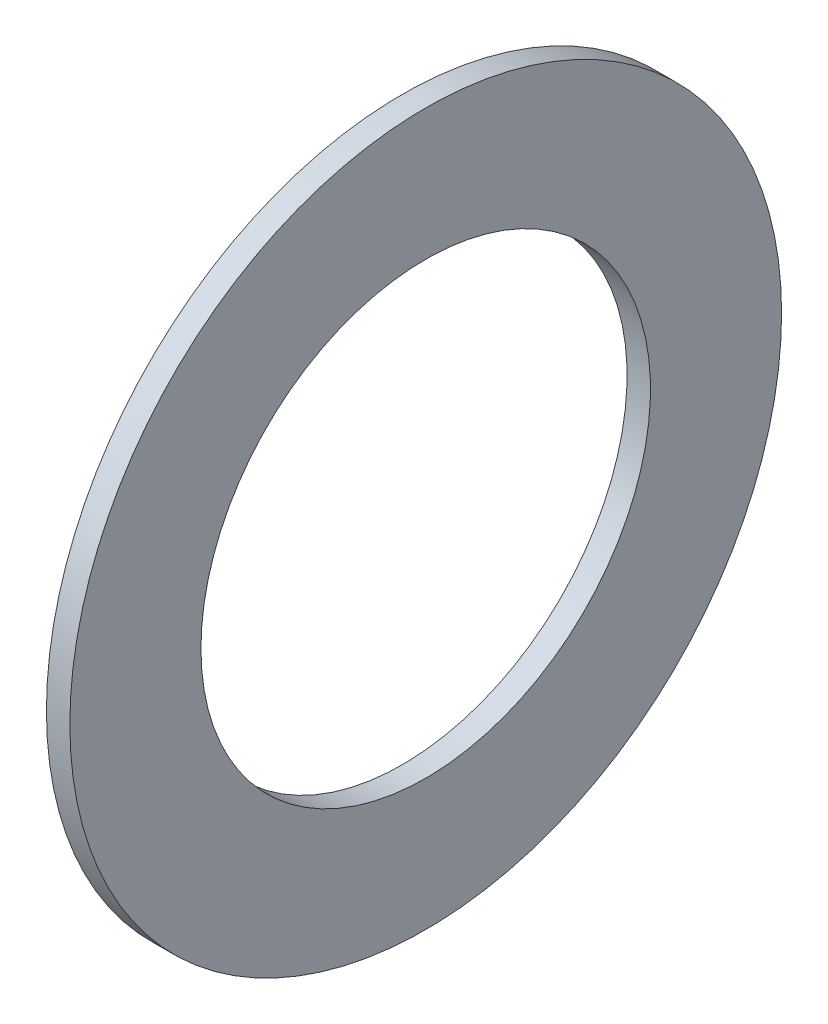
from build123d import *

# Parameters (mm, degrees)
ESQUISSE1_W = 1
ESQUISSE1_H = 5.6


with BuildPart() as part:
    # Esquisse1 → Base-R_volution (revolve)
    with BuildSketch(Plane.XY, mode=Mode.PRIVATE) as base_r_volution_sk:
        with Locations((-0.5, 12.4)):
            Rectangle(ESQUISSE1_W, ESQUISSE1_H)
    revolve(base_r_volution_sk.sketch.rotate(Axis((-11.805633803, 0, 0), (1, 0, 0)), 90), axis=Axis((-11.805633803, 0, 0), (1, 0, 0)))


solid = part.part
